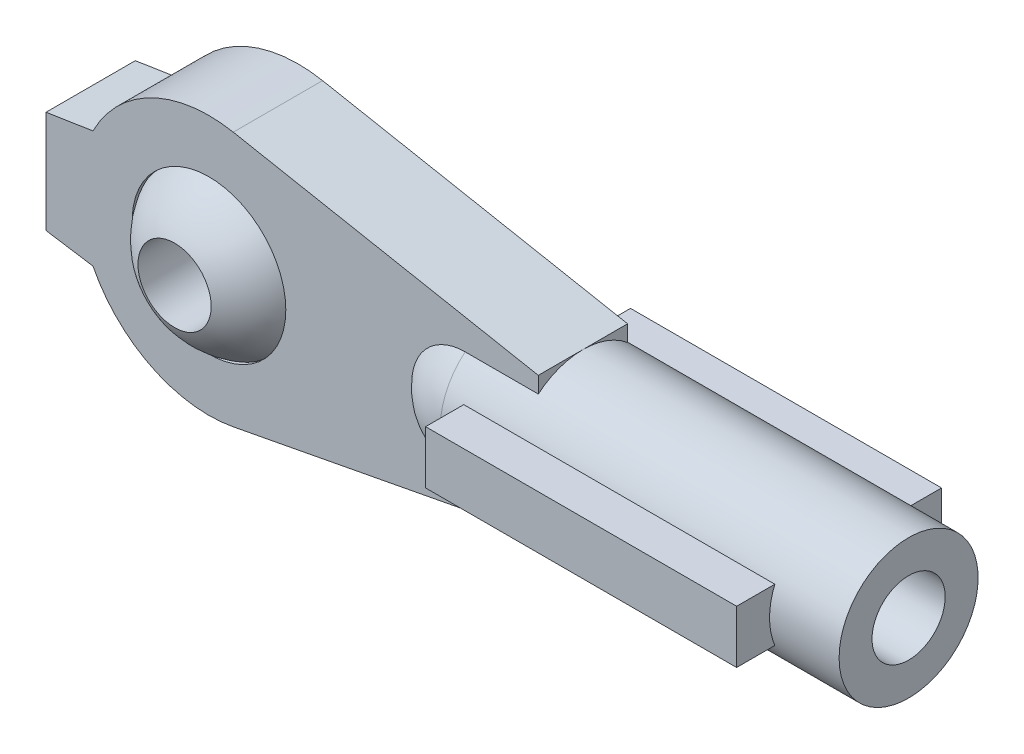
ISO-10303-21;
HEADER;
FILE_DESCRIPTION(('STEP AP214'),'2;1');
FILE_NAME('part.step','',(''),(''),'','','');
FILE_SCHEMA(('AUTOMOTIVE_DESIGN { 1 0 10303 214 1 1 1 1 }'));
ENDSEC;
DATA;
#1=APPLICATION_CONTEXT('core data for automotive mechanical design processes');
#2=APPLICATION_PROTOCOL_DEFINITION('international standard','automotive_design',2000,#1);
#3=PRODUCT_CONTEXT('',#1,'mechanical');
#4=PRODUCT('Part','Part','',(#3));
#5=PRODUCT_RELATED_PRODUCT_CATEGORY('part','',(#4));
#6=PRODUCT_DEFINITION_FORMATION('','',#4);
#7=PRODUCT_DEFINITION_CONTEXT('part definition',#1,'design');
#8=PRODUCT_DEFINITION('design','',#6,#7);
#9=PRODUCT_DEFINITION_SHAPE('','',#8);
#10=(LENGTH_UNIT() NAMED_UNIT(*) SI_UNIT(.MILLI.,.METRE.));
#11=(NAMED_UNIT(*) PLANE_ANGLE_UNIT() SI_UNIT($,.RADIAN.));
#12=(NAMED_UNIT(*) SI_UNIT($,.STERADIAN.) SOLID_ANGLE_UNIT());
#13=UNCERTAINTY_MEASURE_WITH_UNIT(LENGTH_MEASURE(1.E-05),#10,'distance_accuracy_value','');
#14=(GEOMETRIC_REPRESENTATION_CONTEXT(3) GLOBAL_UNCERTAINTY_ASSIGNED_CONTEXT((#13)) GLOBAL_UNIT_ASSIGNED_CONTEXT((#10,
#11,#12)) REPRESENTATION_CONTEXT('',''));
#15=CARTESIAN_POINT('',(0.,0.,0.));
#16=DIRECTION('',(0.,0.,1.));
#17=DIRECTION('',(1.,0.,0.));
#18=AXIS2_PLACEMENT_3D('',#15,#16,#17);
#19=CARTESIAN_POINT('',(0.,0.,0.));
#20=DIRECTION('',(0.,-1.,0.));
#21=DIRECTION('',(-1.,0.,0.));
#22=AXIS2_PLACEMENT_3D('',#19,#20,#21);
#23=SPHERICAL_SURFACE('',#22,2.38);
#24=CARTESIAN_POINT('',(0.,0.,0.));
#25=DIRECTION('',(0.,0.,1.));
#26=DIRECTION('',(1.,0.,0.));
#27=AXIS2_PLACEMENT_3D('',#24,#25,#26);
#28=SPHERICAL_SURFACE('',#27,2.38);
#29=CARTESIAN_POINT('',(0.,0.,-2.1597222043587));
#30=DIRECTION('',(0.,0.,1.));
#31=DIRECTION('',(1.,0.,0.));
#32=AXIS2_PLACEMENT_3D('',#29,#30,#31);
#33=CIRCLE('',#32,1.);
#34=CARTESIAN_POINT('',(1.,0.,-2.1597222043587));
#35=VERTEX_POINT('',#34);
#36=EDGE_CURVE('E11',#35,#35,#33,.F.);
#37=ORIENTED_EDGE('',*,*,#36,.F.);
#38=EDGE_LOOP('',(#37));
#39=FACE_BOUND('',#38,.T.);
#40=CARTESIAN_POINT('',(0.,0.,2.1597222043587));
#41=DIRECTION('',(0.,0.,-1.));
#42=DIRECTION('',(-1.,0.,0.));
#43=AXIS2_PLACEMENT_3D('',#40,#41,#42);
#44=CIRCLE('',#43,1.);
#45=CARTESIAN_POINT('',(-1.,0.,2.1597222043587));
#46=VERTEX_POINT('',#45);
#47=EDGE_CURVE('E48',#46,#46,#44,.F.);
#48=ORIENTED_EDGE('',*,*,#47,.F.);
#49=EDGE_LOOP('',(#48));
#50=FACE_BOUND('',#49,.T.);
#51=ADVANCED_FACE('F42',(#39,#50),#28,.T.);
#52=CARTESIAN_POINT('',(0.,0.,2.19));
#53=DIRECTION('',(0.,0.,-1.));
#54=DIRECTION('',(-1.,0.,0.));
#55=AXIS2_PLACEMENT_3D('',#52,#53,#54);
#56=CYLINDRICAL_SURFACE('',#55,1.);
#57=ORIENTED_EDGE('',*,*,#36,.T.);
#58=EDGE_LOOP('',(#57));
#59=FACE_BOUND('',#58,.T.);
#60=ORIENTED_EDGE('',*,*,#47,.T.);
#61=EDGE_LOOP('',(#60));
#62=FACE_BOUND('',#61,.T.);
#63=ADVANCED_FACE('F54',(#59,#62),#56,.F.);
#64=CLOSED_SHELL('',(#51,#63));
#65=MANIFOLD_SOLID_BREP('B2',#64);
#66=CARTESIAN_POINT('',(0.,0.,0.));
#67=DIRECTION('',(-1.,0.,0.));
#68=DIRECTION('',(0.,0.,1.));
#69=AXIS2_PLACEMENT_3D('',#66,#67,#68);
#70=CYLINDRICAL_SURFACE('',#69,1.9);
#71=CARTESIAN_POINT('',(7.5,0.,0.));
#72=DIRECTION('',(-1.,0.,0.));
#73=DIRECTION('',(0.,0.,-1.));
#74=AXIS2_PLACEMENT_3D('',#71,#72,#73);
#75=CIRCLE('',#74,1.9);
#76=CARTESIAN_POINT('',(7.5,-0.725,1.75623887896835));
#77=VERTEX_POINT('',#76);
#78=CARTESIAN_POINT('',(7.5,0.725,1.75623887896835));
#79=VERTEX_POINT('',#78);
#80=EDGE_CURVE('E264',#77,#79,#75,.T.);
#81=ORIENTED_EDGE('',*,*,#80,.T.);
#82=DIRECTION('',(1.,0.,0.));
#83=VECTOR('',#82,1.);
#84=CARTESIAN_POINT('',(7.5,0.725,1.75623887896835));
#85=LINE('',#84,#83);
#86=CARTESIAN_POINT('',(16.,0.725,1.75623887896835));
#87=VERTEX_POINT('',#86);
#88=EDGE_CURVE('E280',#79,#87,#85,.T.);
#89=ORIENTED_EDGE('',*,*,#88,.T.);
#90=CARTESIAN_POINT('',(16.,0.,0.));
#91=DIRECTION('',(-1.,0.,0.));
#92=DIRECTION('',(0.,0.,-1.));
#93=AXIS2_PLACEMENT_3D('',#90,#91,#92);
#94=CIRCLE('',#93,1.9);
#95=CARTESIAN_POINT('',(16.,-0.725,1.75623887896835));
#96=VERTEX_POINT('',#95);
#97=EDGE_CURVE('E273',#96,#87,#94,.T.);
#98=ORIENTED_EDGE('',*,*,#97,.F.);
#99=DIRECTION('',(1.,0.,0.));
#100=VECTOR('',#99,1.);
#101=CARTESIAN_POINT('',(7.5,-0.725,1.75623887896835));
#102=LINE('',#101,#100);
#103=EDGE_CURVE('E283',#77,#96,#102,.T.);
#104=ORIENTED_EDGE('',*,*,#103,.F.);
#105=EDGE_LOOP('',(#81,#89,#98,#104));
#106=FACE_BOUND('',#105,.T.);
#107=DIRECTION('',(-1.,0.,0.));
#108=VECTOR('',#107,1.);
#109=CARTESIAN_POINT('',(0.,-1.45657131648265,1.22));
#110=LINE('',#109,#108);
#111=CARTESIAN_POINT('',(9.,-1.45657131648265,1.22));
#112=VERTEX_POINT('',#111);
#113=CARTESIAN_POINT('',(7.,-1.45657131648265,1.22));
#114=VERTEX_POINT('',#113);
#115=EDGE_CURVE('E313',#112,#114,#110,.T.);
#116=ORIENTED_EDGE('',*,*,#115,.F.);
#117=CARTESIAN_POINT('',(9.,0.,0.));
#118=DIRECTION('',(-1.,0.,0.));
#119=DIRECTION('',(0.,0.,1.));
#120=AXIS2_PLACEMENT_3D('',#117,#118,#119);
#121=CIRCLE('',#120,1.9);
#122=CARTESIAN_POINT('',(9.,-1.9,0.));
#123=VERTEX_POINT('',#122);
#124=EDGE_CURVE('E302',#112,#123,#121,.F.);
#125=ORIENTED_EDGE('',*,*,#124,.T.);
#126=CARTESIAN_POINT('',(9.,-1.45657131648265,-1.22));
#127=VERTEX_POINT('',#126);
#128=EDGE_CURVE('E309',#123,#127,#121,.F.);
#129=ORIENTED_EDGE('',*,*,#128,.T.);
#130=DIRECTION('',(-1.,0.,0.));
#131=VECTOR('',#130,1.);
#132=CARTESIAN_POINT('',(0.,-1.45657131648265,-1.22));
#133=LINE('',#132,#131);
#134=CARTESIAN_POINT('',(7.,-1.45657131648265,-1.22));
#135=VERTEX_POINT('',#134);
#136=EDGE_CURVE('E310',#127,#135,#133,.T.);
#137=ORIENTED_EDGE('',*,*,#136,.T.);
#138=CARTESIAN_POINT('',(7.,0.,0.));
#139=DIRECTION('',(-1.,0.,0.));
#140=DIRECTION('',(0.,0.,1.));
#141=AXIS2_PLACEMENT_3D('',#138,#139,#140);
#142=CIRCLE('',#141,1.9);
#143=CARTESIAN_POINT('',(7.,1.45657131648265,-1.22));
#144=VERTEX_POINT('',#143);
#145=EDGE_CURVE('E294',#144,#135,#142,.T.);
#146=ORIENTED_EDGE('',*,*,#145,.F.);
#147=DIRECTION('',(-1.,0.,0.));
#148=VECTOR('',#147,1.);
#149=CARTESIAN_POINT('',(0.,1.45657131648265,-1.22));
#150=LINE('',#149,#148);
#151=CARTESIAN_POINT('',(9.,1.45657131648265,-1.22));
#152=VERTEX_POINT('',#151);
#153=EDGE_CURVE('E303',#144,#152,#150,.F.);
#154=ORIENTED_EDGE('',*,*,#153,.T.);
#155=CARTESIAN_POINT('',(9.,1.9,0.));
#156=VERTEX_POINT('',#155);
#157=EDGE_CURVE('E301',#152,#156,#121,.F.);
#158=ORIENTED_EDGE('',*,*,#157,.T.);
#159=CARTESIAN_POINT('',(9.,1.45657131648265,1.22));
#160=VERTEX_POINT('',#159);
#161=EDGE_CURVE('E298',#156,#160,#121,.F.);
#162=ORIENTED_EDGE('',*,*,#161,.T.);
#163=DIRECTION('',(-1.,0.,0.));
#164=VECTOR('',#163,1.);
#165=CARTESIAN_POINT('',(0.,1.45657131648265,1.22));
#166=LINE('',#165,#164);
#167=CARTESIAN_POINT('',(7.,1.45657131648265,1.22));
#168=VERTEX_POINT('',#167);
#169=EDGE_CURVE('E306',#168,#160,#166,.F.);
#170=ORIENTED_EDGE('',*,*,#169,.F.);
#171=EDGE_CURVE('E289',#114,#168,#142,.T.);
#172=ORIENTED_EDGE('',*,*,#171,.F.);
#173=EDGE_LOOP('',(#116,#125,#129,#137,#146,#154,#158,#162,#170,#172));
#174=FACE_BOUND('',#173,.T.);
#175=CARTESIAN_POINT('',(17.9,0.,0.));
#176=DIRECTION('',(-1.,0.,0.));
#177=DIRECTION('',(0.,0.,1.));
#178=AXIS2_PLACEMENT_3D('',#175,#176,#177);
#179=CIRCLE('',#178,1.9);
#180=CARTESIAN_POINT('',(17.9,0.,1.9));
#181=VERTEX_POINT('',#180);
#182=EDGE_CURVE('E295',#181,#181,#179,.T.);
#183=ORIENTED_EDGE('',*,*,#182,.T.);
#184=EDGE_LOOP('',(#183));
#185=FACE_BOUND('',#184,.T.);
#186=CARTESIAN_POINT('',(7.5,0.,0.));
#187=DIRECTION('',(-1.,0.,0.));
#188=DIRECTION('',(0.,0.,-1.));
#189=AXIS2_PLACEMENT_3D('',#186,#187,#188);
#190=CIRCLE('',#189,1.9);
#191=CARTESIAN_POINT('',(7.5,0.725,-1.75623887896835));
#192=VERTEX_POINT('',#191);
#193=CARTESIAN_POINT('',(7.5,-0.725,-1.75623887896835));
#194=VERTEX_POINT('',#193);
#195=EDGE_CURVE('E235',#192,#194,#190,.T.);
#196=ORIENTED_EDGE('',*,*,#195,.T.);
#197=DIRECTION('',(1.,0.,0.));
#198=VECTOR('',#197,1.);
#199=CARTESIAN_POINT('',(7.5,-0.725,-1.75623887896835));
#200=LINE('',#199,#198);
#201=CARTESIAN_POINT('',(16.,-0.725,-1.75623887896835));
#202=VERTEX_POINT('',#201);
#203=EDGE_CURVE('E253',#194,#202,#200,.T.);
#204=ORIENTED_EDGE('',*,*,#203,.T.);
#205=CARTESIAN_POINT('',(16.,0.,0.));
#206=DIRECTION('',(-1.,0.,0.));
#207=DIRECTION('',(0.,0.,-1.));
#208=AXIS2_PLACEMENT_3D('',#205,#206,#207);
#209=CIRCLE('',#208,1.9);
#210=CARTESIAN_POINT('',(16.,0.725,-1.75623887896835));
#211=VERTEX_POINT('',#210);
#212=EDGE_CURVE('E242',#211,#202,#209,.T.);
#213=ORIENTED_EDGE('',*,*,#212,.F.);
#214=DIRECTION('',(1.,0.,0.));
#215=VECTOR('',#214,1.);
#216=CARTESIAN_POINT('',(7.5,0.725,-1.75623887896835));
#217=LINE('',#216,#215);
#218=EDGE_CURVE('E225',#192,#211,#217,.T.);
#219=ORIENTED_EDGE('',*,*,#218,.F.);
#220=EDGE_LOOP('',(#196,#204,#213,#219));
#221=FACE_BOUND('',#220,.T.);
#222=ADVANCED_FACE('F73',(#106,#174,#185,#221),#70,.T.);
#223=CARTESIAN_POINT('',(0.,0.,1.22));
#224=DIRECTION('',(0.,0.,1.));
#225=DIRECTION('',(1.,0.,0.));
#226=AXIS2_PLACEMENT_3D('',#223,#224,#225);
#227=PLANE('',#226);
#228=CARTESIAN_POINT('',(0.,0.,1.22));
#229=DIRECTION('',(0.,0.,1.));
#230=DIRECTION('',(1.,0.,0.));
#231=AXIS2_PLACEMENT_3D('',#228,#229,#230);
#232=CIRCLE('',#231,2.1);
#233=CARTESIAN_POINT('',(2.1,0.,1.22));
#234=VERTEX_POINT('',#233);
#235=EDGE_CURVE('E318',#234,#234,#232,.T.);
#236=ORIENTED_EDGE('',*,*,#235,.F.);
#237=EDGE_LOOP('',(#236));
#238=FACE_BOUND('',#237,.T.);
#239=CARTESIAN_POINT('',(7.,0.,1.22));
#240=DIRECTION('',(0.,0.,1.));
#241=DIRECTION('',(1.,0.,0.));
#242=AXIS2_PLACEMENT_3D('',#239,#240,#241);
#243=CIRCLE('',#242,1.45657131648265);
#244=EDGE_CURVE('E315',#114,#168,#243,.F.);
#245=ORIENTED_EDGE('',*,*,#244,.T.);
#246=ORIENTED_EDGE('',*,*,#169,.T.);
#247=DIRECTION('',(0.,1.,0.));
#248=VECTOR('',#247,1.);
#249=CARTESIAN_POINT('',(9.,-1.9,1.22));
#250=LINE('',#249,#248);
#251=CARTESIAN_POINT('',(9.,1.9,1.22));
#252=VERTEX_POINT('',#251);
#253=EDGE_CURVE('E338',#160,#252,#250,.T.);
#254=ORIENTED_EDGE('',*,*,#253,.T.);
#255=DIRECTION('',(-0.982348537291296,0.187059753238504,0.));
#256=VECTOR('',#255,1.);
#257=CARTESIAN_POINT('',(9.,1.9,1.22));
#258=LINE('',#257,#256);
#259=CARTESIAN_POINT('',(0.664062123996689,3.4873373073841,1.22));
#260=VERTEX_POINT('',#259);
#261=EDGE_CURVE('E342',#252,#260,#258,.T.);
#262=ORIENTED_EDGE('',*,*,#261,.T.);
#263=CARTESIAN_POINT('',(0.,0.,1.22));
#264=DIRECTION('',(0.,0.,1.));
#265=DIRECTION('',(1.,0.,0.));
#266=AXIS2_PLACEMENT_3D('',#263,#264,#265);
#267=CIRCLE('',#266,3.55);
#268=CARTESIAN_POINT('',(-3.16899037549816,1.6,1.22));
#269=VERTEX_POINT('',#268);
#270=EDGE_CURVE('E324',#260,#269,#267,.T.);
#271=ORIENTED_EDGE('',*,*,#270,.T.);
#272=DIRECTION('',(-0.988094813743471,-0.153846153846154,0.));
#273=VECTOR('',#272,1.);
#274=CARTESIAN_POINT('',(-3.16899037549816,1.6,1.22));
#275=LINE('',#274,#273);
#276=CARTESIAN_POINT('',(-4.45351363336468,1.4,1.22));
#277=VERTEX_POINT('',#276);
#278=EDGE_CURVE('E327',#269,#277,#275,.T.);
#279=ORIENTED_EDGE('',*,*,#278,.T.);
#280=DIRECTION('',(0.,-1.,0.));
#281=VECTOR('',#280,1.);
#282=CARTESIAN_POINT('',(-4.45351363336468,1.4,1.22));
#283=LINE('',#282,#281);
#284=CARTESIAN_POINT('',(-4.45351363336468,-1.4,1.22));
#285=VERTEX_POINT('',#284);
#286=EDGE_CURVE('E330',#277,#285,#283,.T.);
#287=ORIENTED_EDGE('',*,*,#286,.T.);
#288=DIRECTION('',(0.988094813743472,-0.153846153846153,0.));
#289=VECTOR('',#288,1.);
#290=CARTESIAN_POINT('',(-4.45351363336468,-1.4,1.22));
#291=LINE('',#290,#289);
#292=CARTESIAN_POINT('',(-3.16899037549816,-1.6,1.22));
#293=VERTEX_POINT('',#292);
#294=EDGE_CURVE('E332',#285,#293,#291,.T.);
#295=ORIENTED_EDGE('',*,*,#294,.T.);
#296=CARTESIAN_POINT('',(0.,0.,1.22));
#297=DIRECTION('',(0.,0.,1.));
#298=DIRECTION('',(1.,0.,0.));
#299=AXIS2_PLACEMENT_3D('',#296,#297,#298);
#300=CIRCLE('',#299,3.55);
#301=CARTESIAN_POINT('',(0.664062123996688,-3.4873373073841,1.22));
#302=VERTEX_POINT('',#301);
#303=EDGE_CURVE('E334',#293,#302,#300,.T.);
#304=ORIENTED_EDGE('',*,*,#303,.T.);
#305=DIRECTION('',(0.982348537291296,0.187059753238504,0.));
#306=VECTOR('',#305,1.);
#307=CARTESIAN_POINT('',(9.,-1.9,1.22));
#308=LINE('',#307,#306);
#309=CARTESIAN_POINT('',(9.,-1.9,1.22));
#310=VERTEX_POINT('',#309);
#311=EDGE_CURVE('E336',#302,#310,#308,.T.);
#312=ORIENTED_EDGE('',*,*,#311,.T.);
#313=EDGE_CURVE('E339',#310,#112,#250,.T.);
#314=ORIENTED_EDGE('',*,*,#313,.T.);
#315=ORIENTED_EDGE('',*,*,#115,.T.);
#316=EDGE_LOOP('',(#245,#246,#254,#262,#271,#279,#287,#295,#304,#312,#314,#315));
#317=FACE_BOUND('',#316,.T.);
#318=ADVANCED_FACE('F410',(#238,#317),#227,.T.);
#319=CARTESIAN_POINT('',(0.,0.,-1.22));
#320=DIRECTION('',(0.,0.,1.));
#321=DIRECTION('',(1.,0.,0.));
#322=AXIS2_PLACEMENT_3D('',#319,#320,#321);
#323=PLANE('',#322);
#324=CARTESIAN_POINT('',(0.,0.,-1.22));
#325=DIRECTION('',(0.,0.,1.));
#326=DIRECTION('',(1.,0.,0.));
#327=AXIS2_PLACEMENT_3D('',#324,#325,#326);
#328=CIRCLE('',#327,2.1);
#329=CARTESIAN_POINT('',(2.1,0.,-1.22));
#330=VERTEX_POINT('',#329);
#331=EDGE_CURVE('E317',#330,#330,#328,.T.);
#332=ORIENTED_EDGE('',*,*,#331,.T.);
#333=EDGE_LOOP('',(#332));
#334=FACE_BOUND('',#333,.T.);
#335=ORIENTED_EDGE('',*,*,#153,.F.);
#336=CARTESIAN_POINT('',(7.,0.,-1.22));
#337=DIRECTION('',(0.,0.,1.));
#338=DIRECTION('',(1.,0.,0.));
#339=AXIS2_PLACEMENT_3D('',#336,#337,#338);
#340=CIRCLE('',#339,1.45657131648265);
#341=EDGE_CURVE('E40',#135,#144,#340,.F.);
#342=ORIENTED_EDGE('',*,*,#341,.F.);
#343=ORIENTED_EDGE('',*,*,#136,.F.);
#344=DIRECTION('',(0.,1.,0.));
#345=VECTOR('',#344,1.);
#346=CARTESIAN_POINT('',(9.,-1.9,-1.22));
#347=LINE('',#346,#345);
#348=CARTESIAN_POINT('',(9.,-1.9,-1.22));
#349=VERTEX_POINT('',#348);
#350=EDGE_CURVE('E359',#349,#127,#347,.T.);
#351=ORIENTED_EDGE('',*,*,#350,.F.);
#352=DIRECTION('',(0.982348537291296,0.187059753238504,0.));
#353=VECTOR('',#352,1.);
#354=CARTESIAN_POINT('',(9.,-1.9,-1.22));
#355=LINE('',#354,#353);
#356=CARTESIAN_POINT('',(0.664062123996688,-3.4873373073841,-1.22));
#357=VERTEX_POINT('',#356);
#358=EDGE_CURVE('E355',#357,#349,#355,.T.);
#359=ORIENTED_EDGE('',*,*,#358,.F.);
#360=CARTESIAN_POINT('',(0.,0.,-1.22));
#361=DIRECTION('',(0.,0.,1.));
#362=DIRECTION('',(1.,0.,0.));
#363=AXIS2_PLACEMENT_3D('',#360,#361,#362);
#364=CIRCLE('',#363,3.55);
#365=CARTESIAN_POINT('',(-3.16899037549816,-1.6,-1.22));
#366=VERTEX_POINT('',#365);
#367=EDGE_CURVE('E353',#366,#357,#364,.T.);
#368=ORIENTED_EDGE('',*,*,#367,.F.);
#369=DIRECTION('',(0.988094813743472,-0.153846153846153,0.));
#370=VECTOR('',#369,1.);
#371=CARTESIAN_POINT('',(-4.45351363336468,-1.4,-1.22));
#372=LINE('',#371,#370);
#373=CARTESIAN_POINT('',(-4.45351363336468,-1.4,-1.22));
#374=VERTEX_POINT('',#373);
#375=EDGE_CURVE('E351',#374,#366,#372,.T.);
#376=ORIENTED_EDGE('',*,*,#375,.F.);
#377=DIRECTION('',(0.,-1.,0.));
#378=VECTOR('',#377,1.);
#379=CARTESIAN_POINT('',(-4.45351363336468,1.4,-1.22));
#380=LINE('',#379,#378);
#381=CARTESIAN_POINT('',(-4.45351363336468,1.4,-1.22));
#382=VERTEX_POINT('',#381);
#383=EDGE_CURVE('E349',#382,#374,#380,.T.);
#384=ORIENTED_EDGE('',*,*,#383,.F.);
#385=DIRECTION('',(-0.988094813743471,-0.153846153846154,0.));
#386=VECTOR('',#385,1.);
#387=CARTESIAN_POINT('',(-3.16899037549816,1.6,-1.22));
#388=LINE('',#387,#386);
#389=CARTESIAN_POINT('',(-3.16899037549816,1.6,-1.22));
#390=VERTEX_POINT('',#389);
#391=EDGE_CURVE('E347',#390,#382,#388,.T.);
#392=ORIENTED_EDGE('',*,*,#391,.F.);
#393=CARTESIAN_POINT('',(0.,0.,-1.22));
#394=DIRECTION('',(0.,0.,1.));
#395=DIRECTION('',(1.,0.,0.));
#396=AXIS2_PLACEMENT_3D('',#393,#394,#395);
#397=CIRCLE('',#396,3.55);
#398=CARTESIAN_POINT('',(0.664062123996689,3.4873373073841,-1.22));
#399=VERTEX_POINT('',#398);
#400=EDGE_CURVE('E321',#399,#390,#397,.T.);
#401=ORIENTED_EDGE('',*,*,#400,.F.);
#402=DIRECTION('',(-0.982348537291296,0.187059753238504,0.));
#403=VECTOR('',#402,1.);
#404=CARTESIAN_POINT('',(9.,1.9,-1.22));
#405=LINE('',#404,#403);
#406=CARTESIAN_POINT('',(9.,1.9,-1.22));
#407=VERTEX_POINT('',#406);
#408=EDGE_CURVE('E328',#407,#399,#405,.T.);
#409=ORIENTED_EDGE('',*,*,#408,.F.);
#410=EDGE_CURVE('E358',#152,#407,#347,.T.);
#411=ORIENTED_EDGE('',*,*,#410,.F.);
#412=EDGE_LOOP('',(#335,#342,#343,#351,#359,#368,#376,#384,#392,#401,#409,#411));
#413=FACE_BOUND('',#412,.T.);
#414=ADVANCED_FACE('F395',(#334,#413),#323,.F.);
#415=CARTESIAN_POINT('',(9.,-1.9,1.22));
#416=DIRECTION('',(-1.,0.,0.));
#417=DIRECTION('',(0.,0.,1.));
#418=AXIS2_PLACEMENT_3D('',#415,#416,#417);
#419=PLANE('',#418);
#420=ORIENTED_EDGE('',*,*,#124,.F.);
#421=ORIENTED_EDGE('',*,*,#313,.F.);
#422=DIRECTION('',(0.,0.,-1.));
#423=VECTOR('',#422,1.);
#424=CARTESIAN_POINT('',(9.,-1.9,1.22));
#425=LINE('',#424,#423);
#426=EDGE_CURVE('E370',#310,#123,#425,.T.);
#427=ORIENTED_EDGE('',*,*,#426,.T.);
#428=EDGE_LOOP('',(#420,#421,#427));
#429=FACE_BOUND('',#428,.T.);
#430=ADVANCED_FACE('F438',(#429),#419,.F.);
#431=ORIENTED_EDGE('',*,*,#128,.F.);
#432=EDGE_CURVE('E369',#123,#349,#425,.T.);
#433=ORIENTED_EDGE('',*,*,#432,.T.);
#434=ORIENTED_EDGE('',*,*,#350,.T.);
#435=EDGE_LOOP('',(#431,#433,#434));
#436=FACE_BOUND('',#435,.T.);
#437=ADVANCED_FACE('F432',(#436),#419,.F.);
#438=ORIENTED_EDGE('',*,*,#157,.F.);
#439=ORIENTED_EDGE('',*,*,#410,.T.);
#440=DIRECTION('',(0.,0.,-1.));
#441=VECTOR('',#440,1.);
#442=CARTESIAN_POINT('',(9.,1.9,1.22));
#443=LINE('',#442,#441);
#444=EDGE_CURVE('E365',#156,#407,#443,.T.);
#445=ORIENTED_EDGE('',*,*,#444,.F.);
#446=EDGE_LOOP('',(#438,#439,#445));
#447=FACE_BOUND('',#446,.T.);
#448=ADVANCED_FACE('F420',(#447),#419,.F.);
#449=ORIENTED_EDGE('',*,*,#161,.F.);
#450=EDGE_CURVE('E366',#252,#156,#443,.T.);
#451=ORIENTED_EDGE('',*,*,#450,.F.);
#452=ORIENTED_EDGE('',*,*,#253,.F.);
#453=EDGE_LOOP('',(#449,#451,#452));
#454=FACE_BOUND('',#453,.T.);
#455=ADVANCED_FACE('F480',(#454),#419,.F.);
#456=CARTESIAN_POINT('',(0.,0.,1.22));
#457=DIRECTION('',(0.,0.,-1.));
#458=DIRECTION('',(-1.,0.,0.));
#459=AXIS2_PLACEMENT_3D('',#456,#457,#458);
#460=CYLINDRICAL_SURFACE('',#459,3.55);
#461=ORIENTED_EDGE('',*,*,#400,.T.);
#462=DIRECTION('',(0.,0.,-1.));
#463=VECTOR('',#462,1.);
#464=CARTESIAN_POINT('',(-3.16899037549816,1.6,1.22));
#465=LINE('',#464,#463);
#466=EDGE_CURVE('E81',#269,#390,#465,.T.);
#467=ORIENTED_EDGE('',*,*,#466,.F.);
#468=ORIENTED_EDGE('',*,*,#270,.F.);
#469=DIRECTION('',(0.,0.,-1.));
#470=VECTOR('',#469,1.);
#471=CARTESIAN_POINT('',(0.664062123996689,3.4873373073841,1.22));
#472=LINE('',#471,#470);
#473=EDGE_CURVE('E344',#260,#399,#472,.T.);
#474=ORIENTED_EDGE('',*,*,#473,.T.);
#475=EDGE_LOOP('',(#461,#467,#468,#474));
#476=FACE_BOUND('',#475,.T.);
#477=ADVANCED_FACE('F75',(#476),#460,.T.);
#478=CARTESIAN_POINT('',(-3.16899037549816,1.6,1.22));
#479=DIRECTION('',(0.153846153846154,-0.988094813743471,0.));
#480=DIRECTION('',(0.988094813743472,0.153846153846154,0.));
#481=AXIS2_PLACEMENT_3D('',#478,#479,#480);
#482=PLANE('',#481);
#483=ORIENTED_EDGE('',*,*,#391,.T.);
#484=DIRECTION('',(0.,0.,-1.));
#485=VECTOR('',#484,1.);
#486=CARTESIAN_POINT('',(-4.45351363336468,1.4,1.22));
#487=LINE('',#486,#485);
#488=EDGE_CURVE('E382',#277,#382,#487,.T.);
#489=ORIENTED_EDGE('',*,*,#488,.F.);
#490=ORIENTED_EDGE('',*,*,#278,.F.);
#491=ORIENTED_EDGE('',*,*,#466,.T.);
#492=EDGE_LOOP('',(#483,#489,#490,#491));
#493=FACE_BOUND('',#492,.T.);
#494=ADVANCED_FACE('F387',(#493),#482,.F.);
#495=CARTESIAN_POINT('',(-4.45351363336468,1.4,1.22));
#496=DIRECTION('',(1.,0.,0.));
#497=DIRECTION('',(0.,0.,-1.));
#498=AXIS2_PLACEMENT_3D('',#495,#496,#497);
#499=PLANE('',#498);
#500=ORIENTED_EDGE('',*,*,#383,.T.);
#501=DIRECTION('',(0.,0.,-1.));
#502=VECTOR('',#501,1.);
#503=CARTESIAN_POINT('',(-4.45351363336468,-1.4,1.22));
#504=LINE('',#503,#502);
#505=EDGE_CURVE('E379',#285,#374,#504,.T.);
#506=ORIENTED_EDGE('',*,*,#505,.F.);
#507=ORIENTED_EDGE('',*,*,#286,.F.);
#508=ORIENTED_EDGE('',*,*,#488,.T.);
#509=EDGE_LOOP('',(#500,#506,#507,#508));
#510=FACE_BOUND('',#509,.T.);
#511=ADVANCED_FACE('F402',(#510),#499,.F.);
#512=CARTESIAN_POINT('',(-4.45351363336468,-1.4,1.22));
#513=DIRECTION('',(0.153846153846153,0.988094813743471,0.));
#514=DIRECTION('',(-0.988094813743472,0.153846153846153,0.));
#515=AXIS2_PLACEMENT_3D('',#512,#513,#514);
#516=PLANE('',#515);
#517=ORIENTED_EDGE('',*,*,#375,.T.);
#518=DIRECTION('',(0.,0.,-1.));
#519=VECTOR('',#518,1.);
#520=CARTESIAN_POINT('',(-3.16899037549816,-1.6,1.22));
#521=LINE('',#520,#519);
#522=EDGE_CURVE('E376',#293,#366,#521,.T.);
#523=ORIENTED_EDGE('',*,*,#522,.F.);
#524=ORIENTED_EDGE('',*,*,#294,.F.);
#525=ORIENTED_EDGE('',*,*,#505,.T.);
#526=EDGE_LOOP('',(#517,#523,#524,#525));
#527=FACE_BOUND('',#526,.T.);
#528=ADVANCED_FACE('F406',(#527),#516,.F.);
#529=CARTESIAN_POINT('',(0.,0.,1.22));
#530=DIRECTION('',(0.,0.,-1.));
#531=DIRECTION('',(-1.,0.,0.));
#532=AXIS2_PLACEMENT_3D('',#529,#530,#531);
#533=CYLINDRICAL_SURFACE('',#532,3.55);
#534=ORIENTED_EDGE('',*,*,#367,.T.);
#535=DIRECTION('',(0.,0.,-1.));
#536=VECTOR('',#535,1.);
#537=CARTESIAN_POINT('',(0.664062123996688,-3.4873373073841,1.22));
#538=LINE('',#537,#536);
#539=EDGE_CURVE('E373',#302,#357,#538,.T.);
#540=ORIENTED_EDGE('',*,*,#539,.F.);
#541=ORIENTED_EDGE('',*,*,#303,.F.);
#542=ORIENTED_EDGE('',*,*,#522,.T.);
#543=EDGE_LOOP('',(#534,#540,#541,#542));
#544=FACE_BOUND('',#543,.T.);
#545=ADVANCED_FACE('F445',(#544),#533,.T.);
#546=CARTESIAN_POINT('',(9.,-1.9,1.22));
#547=DIRECTION('',(-0.187059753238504,0.982348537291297,0.));
#548=DIRECTION('',(-0.982348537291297,-0.187059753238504,0.));
#549=AXIS2_PLACEMENT_3D('',#546,#547,#548);
#550=PLANE('',#549);
#551=ORIENTED_EDGE('',*,*,#358,.T.);
#552=ORIENTED_EDGE('',*,*,#432,.F.);
#553=ORIENTED_EDGE('',*,*,#426,.F.);
#554=ORIENTED_EDGE('',*,*,#311,.F.);
#555=ORIENTED_EDGE('',*,*,#539,.T.);
#556=EDGE_LOOP('',(#551,#552,#553,#554,#555));
#557=FACE_BOUND('',#556,.T.);
#558=ADVANCED_FACE('F443',(#557),#550,.F.);
#559=CARTESIAN_POINT('',(9.,1.9,1.22));
#560=DIRECTION('',(-0.187059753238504,-0.982348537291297,0.));
#561=DIRECTION('',(0.982348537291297,-0.187059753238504,0.));
#562=AXIS2_PLACEMENT_3D('',#559,#560,#561);
#563=PLANE('',#562);
#564=ORIENTED_EDGE('',*,*,#408,.T.);
#565=ORIENTED_EDGE('',*,*,#473,.F.);
#566=ORIENTED_EDGE('',*,*,#261,.F.);
#567=ORIENTED_EDGE('',*,*,#450,.T.);
#568=ORIENTED_EDGE('',*,*,#444,.T.);
#569=EDGE_LOOP('',(#564,#565,#566,#567,#568));
#570=FACE_BOUND('',#569,.T.);
#571=ADVANCED_FACE('F415',(#570),#563,.F.);
#572=CARTESIAN_POINT('',(0.,0.,1.22));
#573=DIRECTION('',(0.,0.,-1.));
#574=DIRECTION('',(-1.,0.,0.));
#575=AXIS2_PLACEMENT_3D('',#572,#573,#574);
#576=CYLINDRICAL_SURFACE('',#575,2.1);
#577=ORIENTED_EDGE('',*,*,#235,.T.);
#578=EDGE_LOOP('',(#577));
#579=FACE_BOUND('',#578,.T.);
#580=ORIENTED_EDGE('',*,*,#331,.F.);
#581=EDGE_LOOP('',(#580));
#582=FACE_BOUND('',#581,.T.);
#583=ADVANCED_FACE('F470',(#579,#582),#576,.F.);
#584=CARTESIAN_POINT('',(7.,0.,0.));
#585=DIRECTION('',(-1.,0.,0.));
#586=DIRECTION('',(0.,1.,0.));
#587=AXIS2_PLACEMENT_3D('',#584,#585,#586);
#588=SPHERICAL_SURFACE('',#587,1.9);
#589=ORIENTED_EDGE('',*,*,#145,.T.);
#590=ORIENTED_EDGE('',*,*,#341,.T.);
#591=EDGE_LOOP('',(#589,#590));
#592=FACE_BOUND('',#591,.T.);
#593=ADVANCED_FACE('F428',(#592),#588,.T.);
#594=CARTESIAN_POINT('',(17.9,1.9,0.));
#595=DIRECTION('',(-1.,0.,0.));
#596=DIRECTION('',(0.,0.,1.));
#597=AXIS2_PLACEMENT_3D('',#594,#595,#596);
#598=PLANE('',#597);
#599=CARTESIAN_POINT('',(17.9,0.,0.));
#600=DIRECTION('',(1.,0.,0.));
#601=DIRECTION('',(0.,0.,-1.));
#602=AXIS2_PLACEMENT_3D('',#599,#600,#601);
#603=CIRCLE('',#602,1.);
#604=CARTESIAN_POINT('',(17.9,0.,-1.));
#605=VERTEX_POINT('',#604);
#606=EDGE_CURVE('E279',#605,#605,#603,.T.);
#607=ORIENTED_EDGE('',*,*,#606,.F.);
#608=EDGE_LOOP('',(#607));
#609=FACE_BOUND('',#608,.T.);
#610=ORIENTED_EDGE('',*,*,#182,.F.);
#611=EDGE_LOOP('',(#610));
#612=FACE_BOUND('',#611,.T.);
#613=ADVANCED_FACE('F466',(#609,#612),#598,.F.);
#614=ORIENTED_EDGE('',*,*,#244,.F.);
#615=ORIENTED_EDGE('',*,*,#171,.T.);
#616=EDGE_LOOP('',(#614,#615));
#617=FACE_BOUND('',#616,.T.);
#618=ADVANCED_FACE('F464',(#617),#588,.T.);
#619=CARTESIAN_POINT('',(7.9,0.,0.));
#620=DIRECTION('',(1.,0.,0.));
#621=DIRECTION('',(0.,0.,-1.));
#622=AXIS2_PLACEMENT_3D('',#619,#620,#621);
#623=CYLINDRICAL_SURFACE('',#622,1.);
#624=CARTESIAN_POINT('',(7.9,0.,0.));
#625=DIRECTION('',(1.,0.,0.));
#626=DIRECTION('',(0.,0.,-1.));
#627=AXIS2_PLACEMENT_3D('',#624,#625,#626);
#628=CIRCLE('',#627,1.);
#629=CARTESIAN_POINT('',(7.9,0.,-1.));
#630=VERTEX_POINT('',#629);
#631=EDGE_CURVE('E286',#630,#630,#628,.T.);
#632=ORIENTED_EDGE('',*,*,#631,.F.);
#633=EDGE_LOOP('',(#632));
#634=FACE_BOUND('',#633,.T.);
#635=ORIENTED_EDGE('',*,*,#606,.T.);
#636=EDGE_LOOP('',(#635));
#637=FACE_BOUND('',#636,.T.);
#638=ADVANCED_FACE('F493',(#634,#637),#623,.F.);
#639=CARTESIAN_POINT('',(7.9,0.,0.));
#640=DIRECTION('',(1.,0.,0.));
#641=DIRECTION('',(0.,0.,-1.));
#642=AXIS2_PLACEMENT_3D('',#639,#640,#641);
#643=PLANE('',#642);
#644=ORIENTED_EDGE('',*,*,#631,.T.);
#645=EDGE_LOOP('',(#644));
#646=FACE_BOUND('',#645,.T.);
#647=ADVANCED_FACE('F497',(#646),#643,.T.);
#648=CARTESIAN_POINT('',(7.5,0.725,2.8));
#649=DIRECTION('',(0.,0.,1.));
#650=DIRECTION('',(1.,0.,0.));
#651=AXIS2_PLACEMENT_3D('',#648,#649,#650);
#652=PLANE('',#651);
#653=DIRECTION('',(0.,-1.,0.));
#654=VECTOR('',#653,1.);
#655=CARTESIAN_POINT('',(16.,0.725,2.8));
#656=LINE('',#655,#654);
#657=CARTESIAN_POINT('',(16.,0.725,2.8));
#658=VERTEX_POINT('',#657);
#659=CARTESIAN_POINT('',(16.,-0.725,2.8));
#660=VERTEX_POINT('',#659);
#661=EDGE_CURVE('E252',#658,#660,#656,.T.);
#662=ORIENTED_EDGE('',*,*,#661,.F.);
#663=DIRECTION('',(1.,0.,0.));
#664=VECTOR('',#663,1.);
#665=CARTESIAN_POINT('',(7.5,0.725,2.8));
#666=LINE('',#665,#664);
#667=CARTESIAN_POINT('',(7.5,0.725,2.8));
#668=VERTEX_POINT('',#667);
#669=EDGE_CURVE('E277',#668,#658,#666,.T.);
#670=ORIENTED_EDGE('',*,*,#669,.F.);
#671=DIRECTION('',(0.,-1.,0.));
#672=VECTOR('',#671,1.);
#673=CARTESIAN_POINT('',(7.5,0.725,2.8));
#674=LINE('',#673,#672);
#675=CARTESIAN_POINT('',(7.5,-0.725,2.8));
#676=VERTEX_POINT('',#675);
#677=EDGE_CURVE('E257',#668,#676,#674,.T.);
#678=ORIENTED_EDGE('',*,*,#677,.T.);
#679=DIRECTION('',(1.,0.,0.));
#680=VECTOR('',#679,1.);
#681=CARTESIAN_POINT('',(7.5,-0.725,2.8));
#682=LINE('',#681,#680);
#683=EDGE_CURVE('E270',#676,#660,#682,.T.);
#684=ORIENTED_EDGE('',*,*,#683,.T.);
#685=EDGE_LOOP('',(#662,#670,#678,#684));
#686=FACE_BOUND('',#685,.T.);
#687=ADVANCED_FACE('F525',(#686),#652,.T.);
#688=CARTESIAN_POINT('',(7.5,0.725,2.8));
#689=DIRECTION('',(0.,1.,0.));
#690=DIRECTION('',(0.,0.,1.));
#691=AXIS2_PLACEMENT_3D('',#688,#689,#690);
#692=PLANE('',#691);
#693=DIRECTION('',(0.,0.,1.));
#694=VECTOR('',#693,1.);
#695=CARTESIAN_POINT('',(16.,0.725,2.8));
#696=LINE('',#695,#694);
#697=EDGE_CURVE('E261',#87,#658,#696,.T.);
#698=ORIENTED_EDGE('',*,*,#697,.F.);
#699=ORIENTED_EDGE('',*,*,#88,.F.);
#700=DIRECTION('',(0.,0.,1.));
#701=VECTOR('',#700,1.);
#702=CARTESIAN_POINT('',(7.5,0.725,2.8));
#703=LINE('',#702,#701);
#704=EDGE_CURVE('E267',#79,#668,#703,.T.);
#705=ORIENTED_EDGE('',*,*,#704,.T.);
#706=ORIENTED_EDGE('',*,*,#669,.T.);
#707=EDGE_LOOP('',(#698,#699,#705,#706));
#708=FACE_BOUND('',#707,.T.);
#709=ADVANCED_FACE('F540',(#708),#692,.T.);
#710=CARTESIAN_POINT('',(7.5,-0.725,2.8));
#711=DIRECTION('',(0.,-1.,0.));
#712=DIRECTION('',(0.,0.,-1.));
#713=AXIS2_PLACEMENT_3D('',#710,#711,#712);
#714=PLANE('',#713);
#715=DIRECTION('',(0.,0.,-1.));
#716=VECTOR('',#715,1.);
#717=CARTESIAN_POINT('',(16.,-0.725,2.8));
#718=LINE('',#717,#716);
#719=EDGE_CURVE('E96',#660,#96,#718,.T.);
#720=ORIENTED_EDGE('',*,*,#719,.F.);
#721=ORIENTED_EDGE('',*,*,#683,.F.);
#722=DIRECTION('',(0.,0.,-1.));
#723=VECTOR('',#722,1.);
#724=CARTESIAN_POINT('',(7.5,-0.725,2.8));
#725=LINE('',#724,#723);
#726=EDGE_CURVE('E260',#676,#77,#725,.T.);
#727=ORIENTED_EDGE('',*,*,#726,.T.);
#728=ORIENTED_EDGE('',*,*,#103,.T.);
#729=EDGE_LOOP('',(#720,#721,#727,#728));
#730=FACE_BOUND('',#729,.T.);
#731=ADVANCED_FACE('F550',(#730),#714,.T.);
#732=CARTESIAN_POINT('',(7.5,0.,0.));
#733=DIRECTION('',(1.,0.,0.));
#734=DIRECTION('',(0.,0.,-1.));
#735=AXIS2_PLACEMENT_3D('',#732,#733,#734);
#736=PLANE('',#735);
#737=ORIENTED_EDGE('',*,*,#677,.F.);
#738=ORIENTED_EDGE('',*,*,#704,.F.);
#739=ORIENTED_EDGE('',*,*,#80,.F.);
#740=ORIENTED_EDGE('',*,*,#726,.F.);
#741=EDGE_LOOP('',(#737,#738,#739,#740));
#742=FACE_BOUND('',#741,.T.);
#743=ADVANCED_FACE('F560',(#742),#736,.F.);
#744=CARTESIAN_POINT('',(16.,0.,0.));
#745=DIRECTION('',(1.,0.,0.));
#746=DIRECTION('',(0.,0.,-1.));
#747=AXIS2_PLACEMENT_3D('',#744,#745,#746);
#748=PLANE('',#747);
#749=ORIENTED_EDGE('',*,*,#661,.T.);
#750=ORIENTED_EDGE('',*,*,#719,.T.);
#751=ORIENTED_EDGE('',*,*,#97,.T.);
#752=ORIENTED_EDGE('',*,*,#697,.T.);
#753=EDGE_LOOP('',(#749,#750,#751,#752));
#754=FACE_BOUND('',#753,.T.);
#755=ADVANCED_FACE('F570',(#754),#748,.T.);
#756=CARTESIAN_POINT('',(7.5,0.725,-2.8));
#757=DIRECTION('',(0.,0.,-1.));
#758=DIRECTION('',(-1.,0.,0.));
#759=AXIS2_PLACEMENT_3D('',#756,#757,#758);
#760=PLANE('',#759);
#761=DIRECTION('',(0.,1.,0.));
#762=VECTOR('',#761,1.);
#763=CARTESIAN_POINT('',(16.,0.725,-2.8));
#764=LINE('',#763,#762);
#765=CARTESIAN_POINT('',(16.,-0.725,-2.8));
#766=VERTEX_POINT('',#765);
#767=CARTESIAN_POINT('',(16.,0.725,-2.8));
#768=VERTEX_POINT('',#767);
#769=EDGE_CURVE('E247',#766,#768,#764,.T.);
#770=ORIENTED_EDGE('',*,*,#769,.F.);
#771=DIRECTION('',(1.,0.,0.));
#772=VECTOR('',#771,1.);
#773=CARTESIAN_POINT('',(7.5,-0.725,-2.8));
#774=LINE('',#773,#772);
#775=CARTESIAN_POINT('',(7.5,-0.725,-2.8));
#776=VERTEX_POINT('',#775);
#777=EDGE_CURVE('E238',#776,#766,#774,.T.);
#778=ORIENTED_EDGE('',*,*,#777,.F.);
#779=DIRECTION('',(0.,1.,0.));
#780=VECTOR('',#779,1.);
#781=CARTESIAN_POINT('',(7.5,0.725,-2.8));
#782=LINE('',#781,#780);
#783=CARTESIAN_POINT('',(7.5,0.725,-2.8));
#784=VERTEX_POINT('',#783);
#785=EDGE_CURVE('E232',#776,#784,#782,.T.);
#786=ORIENTED_EDGE('',*,*,#785,.T.);
#787=DIRECTION('',(1.,0.,0.));
#788=VECTOR('',#787,1.);
#789=CARTESIAN_POINT('',(7.5,0.725,-2.8));
#790=LINE('',#789,#788);
#791=EDGE_CURVE('E217',#784,#768,#790,.T.);
#792=ORIENTED_EDGE('',*,*,#791,.T.);
#793=EDGE_LOOP('',(#770,#778,#786,#792));
#794=FACE_BOUND('',#793,.T.);
#795=ADVANCED_FACE('F237',(#794),#760,.T.);
#796=CARTESIAN_POINT('',(7.5,-0.725,-1.75623887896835));
#797=DIRECTION('',(0.,-1.,0.));
#798=DIRECTION('',(0.,0.,-1.));
#799=AXIS2_PLACEMENT_3D('',#796,#797,#798);
#800=PLANE('',#799);
#801=DIRECTION('',(0.,0.,-1.));
#802=VECTOR('',#801,1.);
#803=CARTESIAN_POINT('',(16.,-0.725,-1.75623887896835));
#804=LINE('',#803,#802);
#805=EDGE_CURVE('E239',#202,#766,#804,.T.);
#806=ORIENTED_EDGE('',*,*,#805,.F.);
#807=ORIENTED_EDGE('',*,*,#203,.F.);
#808=DIRECTION('',(0.,0.,-1.));
#809=VECTOR('',#808,1.);
#810=CARTESIAN_POINT('',(7.5,-0.725,-1.75623887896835));
#811=LINE('',#810,#809);
#812=EDGE_CURVE('E226',#194,#776,#811,.T.);
#813=ORIENTED_EDGE('',*,*,#812,.T.);
#814=ORIENTED_EDGE('',*,*,#777,.T.);
#815=EDGE_LOOP('',(#806,#807,#813,#814));
#816=FACE_BOUND('',#815,.T.);
#817=ADVANCED_FACE('F588',(#816),#800,.T.);
#818=CARTESIAN_POINT('',(7.5,0.725,-1.75623887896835));
#819=DIRECTION('',(0.,1.,0.));
#820=DIRECTION('',(0.,0.,1.));
#821=AXIS2_PLACEMENT_3D('',#818,#819,#820);
#822=PLANE('',#821);
#823=DIRECTION('',(0.,0.,1.));
#824=VECTOR('',#823,1.);
#825=CARTESIAN_POINT('',(16.,0.725,-1.75623887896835));
#826=LINE('',#825,#824);
#827=EDGE_CURVE('E88',#768,#211,#826,.T.);
#828=ORIENTED_EDGE('',*,*,#827,.F.);
#829=ORIENTED_EDGE('',*,*,#791,.F.);
#830=DIRECTION('',(0.,0.,1.));
#831=VECTOR('',#830,1.);
#832=CARTESIAN_POINT('',(7.5,0.725,-1.75623887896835));
#833=LINE('',#832,#831);
#834=EDGE_CURVE('E220',#784,#192,#833,.T.);
#835=ORIENTED_EDGE('',*,*,#834,.T.);
#836=ORIENTED_EDGE('',*,*,#218,.T.);
#837=EDGE_LOOP('',(#828,#829,#835,#836));
#838=FACE_BOUND('',#837,.T.);
#839=ADVANCED_FACE('F219',(#838),#822,.T.);
#840=CARTESIAN_POINT('',(7.5,0.,0.));
#841=DIRECTION('',(1.,0.,0.));
#842=DIRECTION('',(0.,0.,-1.));
#843=AXIS2_PLACEMENT_3D('',#840,#841,#842);
#844=PLANE('',#843);
#845=ORIENTED_EDGE('',*,*,#785,.F.);
#846=ORIENTED_EDGE('',*,*,#812,.F.);
#847=ORIENTED_EDGE('',*,*,#195,.F.);
#848=ORIENTED_EDGE('',*,*,#834,.F.);
#849=EDGE_LOOP('',(#845,#846,#847,#848));
#850=FACE_BOUND('',#849,.T.);
#851=ADVANCED_FACE('F230',(#850),#844,.F.);
#852=CARTESIAN_POINT('',(16.,0.,0.));
#853=DIRECTION('',(1.,0.,0.));
#854=DIRECTION('',(0.,0.,-1.));
#855=AXIS2_PLACEMENT_3D('',#852,#853,#854);
#856=PLANE('',#855);
#857=ORIENTED_EDGE('',*,*,#769,.T.);
#858=ORIENTED_EDGE('',*,*,#827,.T.);
#859=ORIENTED_EDGE('',*,*,#212,.T.);
#860=ORIENTED_EDGE('',*,*,#805,.T.);
#861=EDGE_LOOP('',(#857,#858,#859,#860));
#862=FACE_BOUND('',#861,.T.);
#863=ADVANCED_FACE('F614',(#862),#856,.T.);
#864=CLOSED_SHELL('',(#222,#318,#414,#430,#437,#448,#455,#477,#494,#511,#528,#545,#558,#571,
#583,#593,#613,#618,#638,#647,#687,#709,#731,#743,#755,#795,#817,#839,#851,#863));
#865=MANIFOLD_SOLID_BREP('B6',#864);
#866=ADVANCED_BREP_SHAPE_REPRESENTATION('',(#18,#65,#865),#14);
#867=SHAPE_DEFINITION_REPRESENTATION(#9,#866);
ENDSEC;
END-ISO-10303-21;
